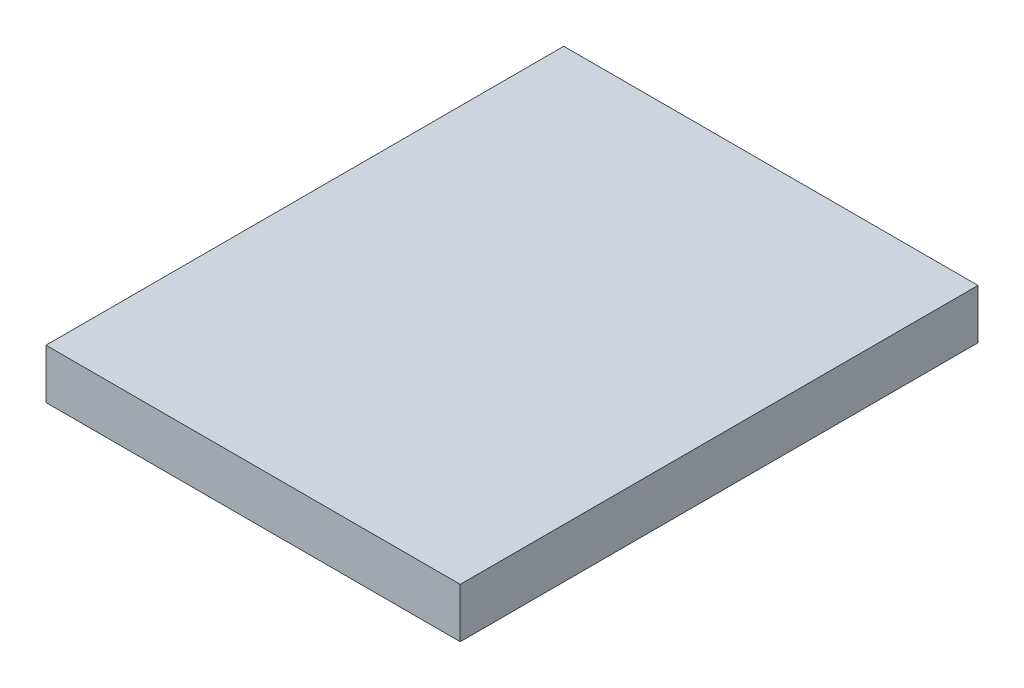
from build123d import *

# Parameters (mm, degrees)
ESQUISSE1_W          = 100
ESQUISSE1_H          = 12
BASE_EXTRUSION_DEPTH = 125


with BuildPart() as part:
    # Esquisse1 → Base-Extrusion (new body)
    with BuildSketch(Plane.XY):
        with Locations((50, -6)):
            Rectangle(ESQUISSE1_W, ESQUISSE1_H)
    extrude(amount=BASE_EXTRUSION_DEPTH)


solid = part.part
